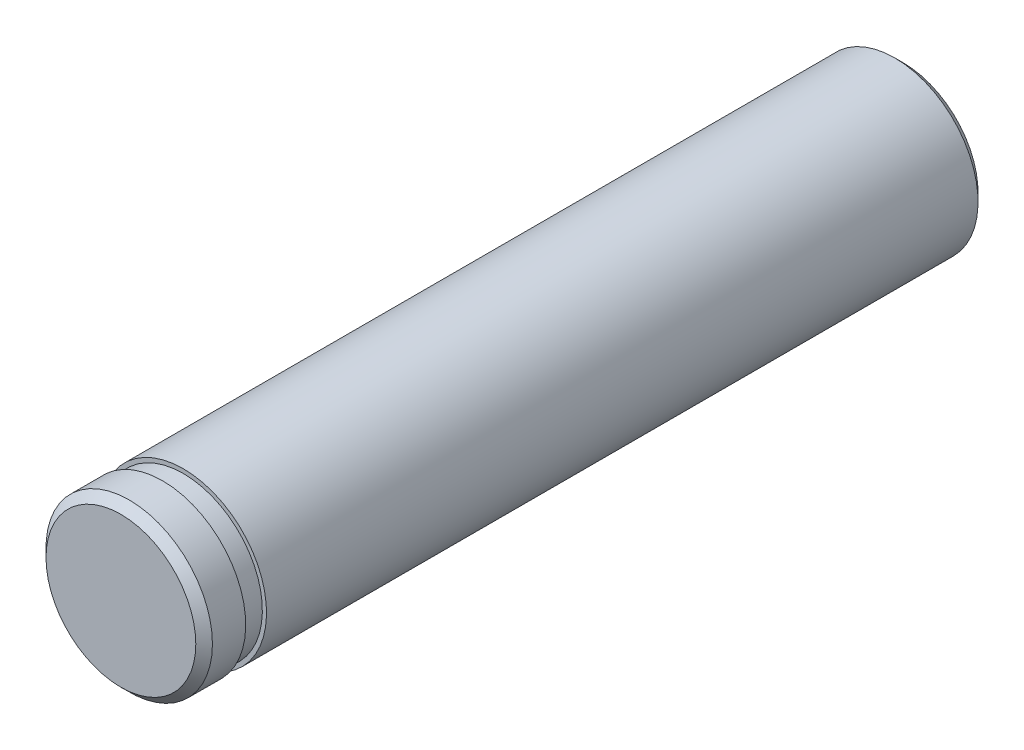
ISO-10303-21;
HEADER;
FILE_DESCRIPTION(('STEP AP214'),'2;1');
FILE_NAME('part.step','',(''),(''),'','','');
FILE_SCHEMA(('AUTOMOTIVE_DESIGN { 1 0 10303 214 1 1 1 1 }'));
ENDSEC;
DATA;
#1=APPLICATION_CONTEXT('core data for automotive mechanical design processes');
#2=APPLICATION_PROTOCOL_DEFINITION('international standard','automotive_design',2000,#1);
#3=PRODUCT_CONTEXT('',#1,'mechanical');
#4=PRODUCT('Part','Part','',(#3));
#5=PRODUCT_RELATED_PRODUCT_CATEGORY('part','',(#4));
#6=PRODUCT_DEFINITION_FORMATION('','',#4);
#7=PRODUCT_DEFINITION_CONTEXT('part definition',#1,'design');
#8=PRODUCT_DEFINITION('design','',#6,#7);
#9=PRODUCT_DEFINITION_SHAPE('','',#8);
#10=(LENGTH_UNIT() NAMED_UNIT(*) SI_UNIT(.MILLI.,.METRE.));
#11=(NAMED_UNIT(*) PLANE_ANGLE_UNIT() SI_UNIT($,.RADIAN.));
#12=(NAMED_UNIT(*) SI_UNIT($,.STERADIAN.) SOLID_ANGLE_UNIT());
#13=UNCERTAINTY_MEASURE_WITH_UNIT(LENGTH_MEASURE(1.E-05),#10,'distance_accuracy_value','');
#14=(GEOMETRIC_REPRESENTATION_CONTEXT(3) GLOBAL_UNCERTAINTY_ASSIGNED_CONTEXT((#13)) GLOBAL_UNIT_ASSIGNED_CONTEXT((#10,
#11,#12)) REPRESENTATION_CONTEXT('',''));
#15=CARTESIAN_POINT('',(0.,0.,0.));
#16=DIRECTION('',(0.,0.,1.));
#17=DIRECTION('',(1.,0.,0.));
#18=AXIS2_PLACEMENT_3D('',#15,#16,#17);
#19=CARTESIAN_POINT('',(4.65997009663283,-28.5008064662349,31.3));
#20=DIRECTION('',(0.,0.,1.));
#21=DIRECTION('',(0.,-1.,0.));
#22=AXIS2_PLACEMENT_3D('',#19,#20,#21);
#23=PLANE('',#22);
#24=CARTESIAN_POINT('',(4.23633645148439,-26.5461876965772,31.3));
#25=DIRECTION('',(0.,0.,1.));
#26=DIRECTION('',(0.,-1.,0.));
#27=AXIS2_PLACEMENT_3D('',#24,#25,#26);
#28=CIRCLE('',#27,1.8);
#29=CARTESIAN_POINT('',(4.23633645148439,-28.3461876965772,31.3));
#30=VERTEX_POINT('',#29);
#31=EDGE_CURVE('E10',#30,#30,#28,.T.);
#32=ORIENTED_EDGE('',*,*,#31,.T.);
#33=EDGE_LOOP('',(#32));
#34=FACE_BOUND('',#33,.T.);
#35=ADVANCED_FACE('F33',(#34),#23,.T.);
#36=CARTESIAN_POINT('',(4.23633645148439,-26.5461876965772,12.5));
#37=DIRECTION('',(0.,0.,-1.));
#38=DIRECTION('',(0.,1.,0.));
#39=AXIS2_PLACEMENT_3D('',#36,#37,#38);
#40=CYLINDRICAL_SURFACE('',#39,2.);
#41=CARTESIAN_POINT('',(4.23633645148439,-26.5461876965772,31.1));
#42=DIRECTION('',(0.,0.,1.));
#43=DIRECTION('',(1.,0.,0.));
#44=AXIS2_PLACEMENT_3D('',#41,#42,#43);
#45=CIRCLE('',#44,2.);
#46=CARTESIAN_POINT('',(6.23633645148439,-26.5461876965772,31.1));
#47=VERTEX_POINT('',#46);
#48=EDGE_CURVE('E40',#47,#47,#45,.F.);
#49=ORIENTED_EDGE('',*,*,#48,.T.);
#50=EDGE_LOOP('',(#49));
#51=FACE_BOUND('',#50,.T.);
#52=CARTESIAN_POINT('',(4.23633645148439,-26.5461876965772,30.3));
#53=DIRECTION('',(0.,0.,-1.));
#54=DIRECTION('',(0.,1.,0.));
#55=AXIS2_PLACEMENT_3D('',#52,#53,#54);
#56=CIRCLE('',#55,2.);
#57=CARTESIAN_POINT('',(4.23633645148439,-24.5461876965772,30.3));
#58=VERTEX_POINT('',#57);
#59=EDGE_CURVE('E53',#58,#58,#56,.T.);
#60=ORIENTED_EDGE('',*,*,#59,.F.);
#61=EDGE_LOOP('',(#60));
#62=FACE_BOUND('',#61,.T.);
#63=ADVANCED_FACE('F84',(#51,#62),#40,.T.);
#64=CARTESIAN_POINT('',(4.65997009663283,-28.5008064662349,30.3));
#65=DIRECTION('',(0.,0.,-1.));
#66=DIRECTION('',(0.,1.,0.));
#67=AXIS2_PLACEMENT_3D('',#64,#65,#66);
#68=PLANE('',#67);
#69=ORIENTED_EDGE('',*,*,#59,.T.);
#70=EDGE_LOOP('',(#69));
#71=FACE_BOUND('',#70,.T.);
#72=CARTESIAN_POINT('',(4.23633645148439,-26.5461876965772,30.3));
#73=DIRECTION('',(0.,0.,-1.));
#74=DIRECTION('',(0.,1.,0.));
#75=AXIS2_PLACEMENT_3D('',#72,#73,#74);
#76=CIRCLE('',#75,1.9);
#77=CARTESIAN_POINT('',(4.23633645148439,-24.6461876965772,30.3));
#78=VERTEX_POINT('',#77);
#79=EDGE_CURVE('E56',#78,#78,#76,.T.);
#80=ORIENTED_EDGE('',*,*,#79,.F.);
#81=EDGE_LOOP('',(#80));
#82=FACE_BOUND('',#81,.T.);
#83=ADVANCED_FACE('F80',(#71,#82),#68,.T.);
#84=CARTESIAN_POINT('',(4.23633645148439,-26.5461876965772,12.5));
#85=DIRECTION('',(0.,0.,-1.));
#86=DIRECTION('',(0.,1.,0.));
#87=AXIS2_PLACEMENT_3D('',#84,#85,#86);
#88=CYLINDRICAL_SURFACE('',#87,1.9);
#89=ORIENTED_EDGE('',*,*,#79,.T.);
#90=EDGE_LOOP('',(#89));
#91=FACE_BOUND('',#90,.T.);
#92=CARTESIAN_POINT('',(4.23633645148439,-26.5461876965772,29.8));
#93=DIRECTION('',(0.,0.,-1.));
#94=DIRECTION('',(0.,1.,0.));
#95=AXIS2_PLACEMENT_3D('',#92,#93,#94);
#96=CIRCLE('',#95,1.9);
#97=CARTESIAN_POINT('',(4.23633645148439,-24.6461876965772,29.8));
#98=VERTEX_POINT('',#97);
#99=EDGE_CURVE('E59',#98,#98,#96,.T.);
#100=ORIENTED_EDGE('',*,*,#99,.F.);
#101=EDGE_LOOP('',(#100));
#102=FACE_BOUND('',#101,.T.);
#103=ADVANCED_FACE('F70',(#91,#102),#88,.T.);
#104=CARTESIAN_POINT('',(4.65997009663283,-28.5008064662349,29.8));
#105=DIRECTION('',(0.,0.,1.));
#106=DIRECTION('',(0.,-1.,0.));
#107=AXIS2_PLACEMENT_3D('',#104,#105,#106);
#108=PLANE('',#107);
#109=ORIENTED_EDGE('',*,*,#99,.T.);
#110=EDGE_LOOP('',(#109));
#111=FACE_BOUND('',#110,.T.);
#112=CARTESIAN_POINT('',(4.23633645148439,-26.5461876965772,29.8));
#113=DIRECTION('',(0.,0.,-1.));
#114=DIRECTION('',(0.,1.,0.));
#115=AXIS2_PLACEMENT_3D('',#112,#113,#114);
#116=CIRCLE('',#115,2.);
#117=CARTESIAN_POINT('',(4.23633645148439,-24.5461876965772,29.8));
#118=VERTEX_POINT('',#117);
#119=EDGE_CURVE('E62',#118,#118,#116,.T.);
#120=ORIENTED_EDGE('',*,*,#119,.F.);
#121=EDGE_LOOP('',(#120));
#122=FACE_BOUND('',#121,.T.);
#123=ADVANCED_FACE('F68',(#111,#122),#108,.T.);
#124=CARTESIAN_POINT('',(4.23633645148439,-26.5461876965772,12.5));
#125=DIRECTION('',(0.,0.,-1.));
#126=DIRECTION('',(0.,1.,0.));
#127=AXIS2_PLACEMENT_3D('',#124,#125,#126);
#128=CYLINDRICAL_SURFACE('',#127,2.);
#129=CARTESIAN_POINT('',(4.23633645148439,-26.5461876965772,12.7));
#130=DIRECTION('',(0.,0.,-1.));
#131=DIRECTION('',(-1.,0.,0.));
#132=AXIS2_PLACEMENT_3D('',#129,#130,#131);
#133=CIRCLE('',#132,2.);
#134=CARTESIAN_POINT('',(2.23633645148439,-26.5461876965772,12.7));
#135=VERTEX_POINT('',#134);
#136=EDGE_CURVE('E44',#135,#135,#133,.F.);
#137=ORIENTED_EDGE('',*,*,#136,.T.);
#138=EDGE_LOOP('',(#137));
#139=FACE_BOUND('',#138,.T.);
#140=ORIENTED_EDGE('',*,*,#119,.T.);
#141=EDGE_LOOP('',(#140));
#142=FACE_BOUND('',#141,.T.);
#143=ADVANCED_FACE('F66',(#139,#142),#128,.T.);
#144=CARTESIAN_POINT('',(4.65997009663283,-28.5008064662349,12.5));
#145=DIRECTION('',(0.,0.,-1.));
#146=DIRECTION('',(0.,1.,0.));
#147=AXIS2_PLACEMENT_3D('',#144,#145,#146);
#148=PLANE('',#147);
#149=CARTESIAN_POINT('',(4.23633645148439,-26.5461876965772,12.5));
#150=DIRECTION('',(0.,0.,-1.));
#151=DIRECTION('',(0.,1.,0.));
#152=AXIS2_PLACEMENT_3D('',#149,#150,#151);
#153=CIRCLE('',#152,1.79999999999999);
#154=CARTESIAN_POINT('',(4.23633645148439,-24.7461876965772,12.5));
#155=VERTEX_POINT('',#154);
#156=EDGE_CURVE('E48',#155,#155,#153,.T.);
#157=ORIENTED_EDGE('',*,*,#156,.T.);
#158=EDGE_LOOP('',(#157));
#159=FACE_BOUND('',#158,.T.);
#160=ADVANCED_FACE('F77',(#159),#148,.T.);
#161=CARTESIAN_POINT('',(4.23633645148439,-26.5461876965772,12.5));
#162=DIRECTION('',(0.,0.,1.));
#163=DIRECTION('',(1.,0.,0.));
#164=AXIS2_PLACEMENT_3D('',#161,#162,#163);
#165=CONICAL_SURFACE('',#164,1.79999999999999,0.785398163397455);
#166=ORIENTED_EDGE('',*,*,#136,.F.);
#167=EDGE_LOOP('',(#166));
#168=FACE_BOUND('',#167,.T.);
#169=ORIENTED_EDGE('',*,*,#156,.F.);
#170=EDGE_LOOP('',(#169));
#171=FACE_BOUND('',#170,.T.);
#172=ADVANCED_FACE('F91',(#168,#171),#165,.T.);
#173=CARTESIAN_POINT('',(4.23633645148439,-26.5461876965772,31.1));
#174=DIRECTION('',(0.,0.,-1.));
#175=DIRECTION('',(-1.,0.,0.));
#176=AXIS2_PLACEMENT_3D('',#173,#174,#175);
#177=CONICAL_SURFACE('',#176,2.,0.785398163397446);
#178=ORIENTED_EDGE('',*,*,#31,.F.);
#179=EDGE_LOOP('',(#178));
#180=FACE_BOUND('',#179,.T.);
#181=ORIENTED_EDGE('',*,*,#48,.F.);
#182=EDGE_LOOP('',(#181));
#183=FACE_BOUND('',#182,.T.);
#184=ADVANCED_FACE('F35',(#180,#183),#177,.T.);
#185=CLOSED_SHELL('',(#35,#63,#83,#103,#123,#143,#160,#172,#184));
#186=MANIFOLD_SOLID_BREP('B2',#185);
#187=ADVANCED_BREP_SHAPE_REPRESENTATION('',(#18,#186),#14);
#188=SHAPE_DEFINITION_REPRESENTATION(#9,#187);
ENDSEC;
END-ISO-10303-21;
